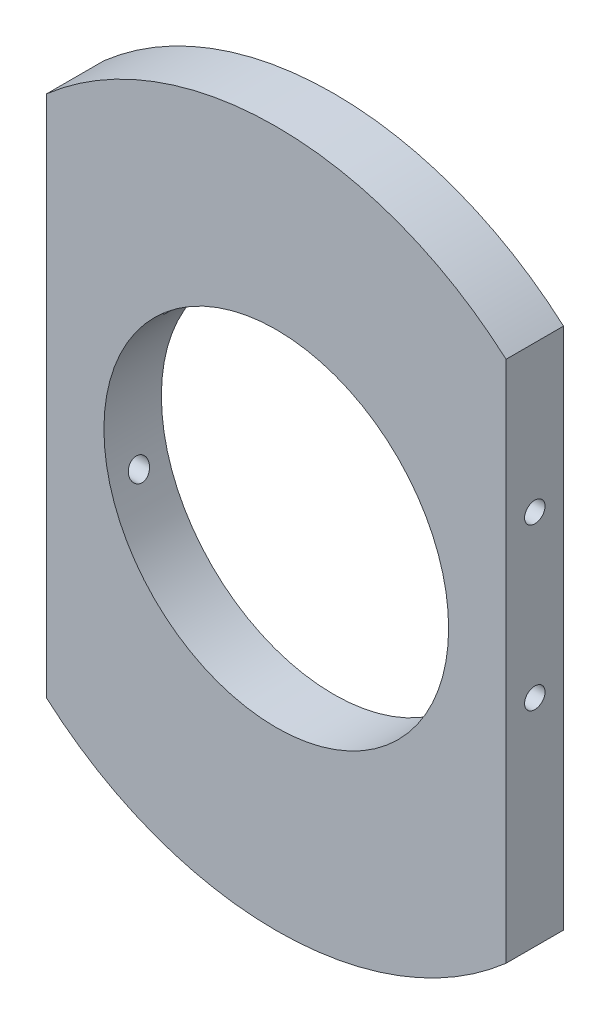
from build123d import *

# Parameters (mm, degrees)
SKETCH1_R                      = 38.481
EXTRUDE1_DEPTH                 = 6.35
SKETCH4_R                      = 19.05
EXTRUDE2_DEPTH                 = 55.789572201
SKETCH5_OUTSIDE_W              = 100.768
SKETCH5_OUTSIDE_H              = 100.768
SKETCH5_OUTSIDE_W_2            = 50.8
SKETCH5_OUTSIDE_H_2            = 90.165032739
EXTRUDE3_DEPTH                 = 55.789572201
F_4_40_TAPPED_HOLE1_AT_2_COUNT = 2
F_4_40_TAPPED_HOLE1_AT_2_PITCH = 17.78


with BuildPart() as part:
    # Sketch1 → Extrude1 (new body)
    with BuildSketch(Plane.XY):
        Circle(SKETCH1_R)
    extrude(amount=EXTRUDE1_DEPTH)

    # Sketch4 → Extrude2 (cut, through all)
    with BuildSketch(Plane.XY.offset(6.35)):
        Circle(SKETCH4_R)
    extrude(amount=-EXTRUDE2_DEPTH, mode=Mode.SUBTRACT)

    # Sketch5 outside → Extrude3 (cut, through all)
    with BuildSketch(Plane.XY.offset(6.35)):
        Rectangle(SKETCH5_OUTSIDE_W, SKETCH5_OUTSIDE_H)
        with Locations((0, -3.959481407)):
            Rectangle(SKETCH5_OUTSIDE_W_2, SKETCH5_OUTSIDE_H_2, mode=Mode.SUBTRACT)
    extrude(amount=-EXTRUDE3_DEPTH, mode=Mode.SUBTRACT)

    # Sketch6 → 4-40 Tapped Hole1 (revolve, cut)
    with BuildSketch(Plane(origin=(25.4, 12.7, 3.175), x_dir=(0, 0, -1), z_dir=(0, 1, 0))):
        Polygon((0, 0), (0, 12.109152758), (1.1303, 11.43), (1.1303, 0), align=None)
    f_4_40_tapped_hole1 = revolve(axis=Axis((31.75, 12.7, 3.175), (-1, 0, 0)), mode=Mode.SUBTRACT)

    # 4-40 Tapped Hole1 at 2: 4-40 Tapped Hole1 ×2
    with Locations(*[(0, -i * F_4_40_TAPPED_HOLE1_AT_2_PITCH, 0) for i in range(1, F_4_40_TAPPED_HOLE1_AT_2_COUNT)]):
        add(f_4_40_tapped_hole1, mode=Mode.SUBTRACT)

    # Mirror1: 4-40 Tapped Hole1 across plane
    add(f_4_40_tapped_hole1.mirror(Plane(origin=(0, 0, 0), x_dir=(0, 0, 1), z_dir=(1, 0, 0))), mode=Mode.SUBTRACT)

    # Mirror1 copy 1 sketch → Mirror1 copy 1 (revolve, cut)
    with BuildSketch(Plane(origin=(-25.4, -5.08, 3.175), x_dir=(0, 0, -1), z_dir=(0, 1, 0))):
        Polygon((0, 0), (0, -12.109152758), (1.1303, -11.43), (1.1303, 0), align=None)
    revolve(axis=Axis((-31.75, -5.08, 3.175), (-1, 0, 0)), mode=Mode.SUBTRACT)


solid = part.part
